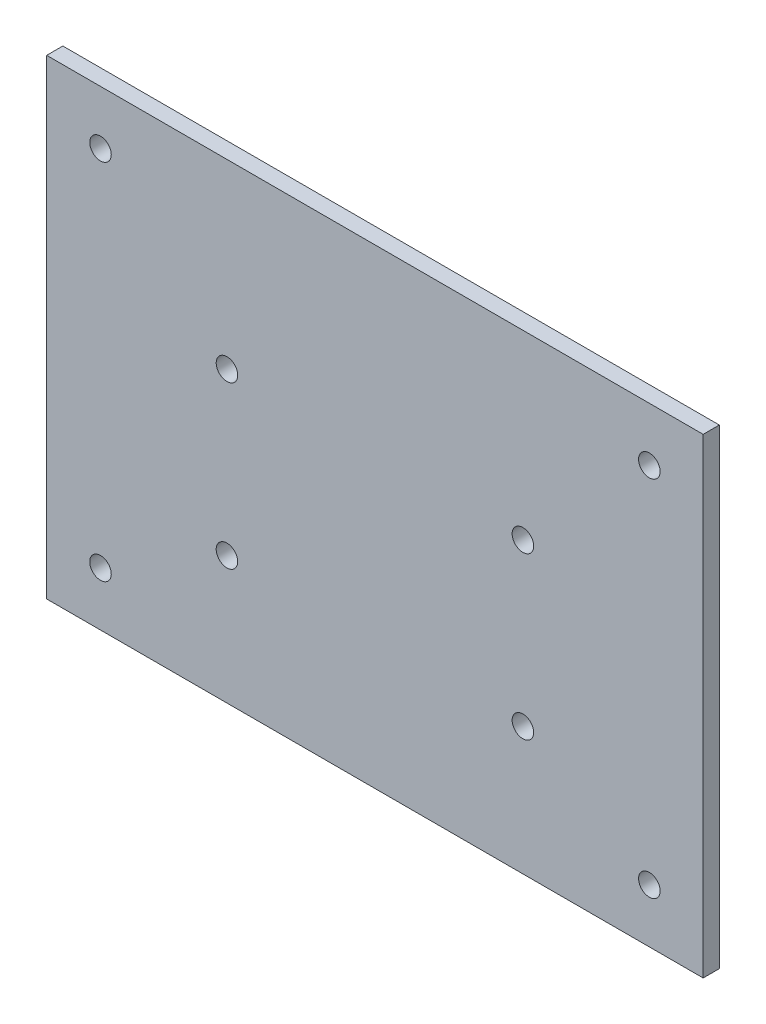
ISO-10303-21;
HEADER;
FILE_DESCRIPTION(('STEP AP214'),'2;1');
FILE_NAME('part.step','',(''),(''),'','','');
FILE_SCHEMA(('AUTOMOTIVE_DESIGN { 1 0 10303 214 1 1 1 1 }'));
ENDSEC;
DATA;
#1=APPLICATION_CONTEXT('core data for automotive mechanical design processes');
#2=APPLICATION_PROTOCOL_DEFINITION('international standard','automotive_design',2000,#1);
#3=PRODUCT_CONTEXT('',#1,'mechanical');
#4=PRODUCT('Part','Part','',(#3));
#5=PRODUCT_RELATED_PRODUCT_CATEGORY('part','',(#4));
#6=PRODUCT_DEFINITION_FORMATION('','',#4);
#7=PRODUCT_DEFINITION_CONTEXT('part definition',#1,'design');
#8=PRODUCT_DEFINITION('design','',#6,#7);
#9=PRODUCT_DEFINITION_SHAPE('','',#8);
#10=(LENGTH_UNIT() NAMED_UNIT(*) SI_UNIT(.MILLI.,.METRE.));
#11=(NAMED_UNIT(*) PLANE_ANGLE_UNIT() SI_UNIT($,.RADIAN.));
#12=(NAMED_UNIT(*) SI_UNIT($,.STERADIAN.) SOLID_ANGLE_UNIT());
#13=UNCERTAINTY_MEASURE_WITH_UNIT(LENGTH_MEASURE(1.E-05),#10,'distance_accuracy_value','');
#14=(GEOMETRIC_REPRESENTATION_CONTEXT(3) GLOBAL_UNCERTAINTY_ASSIGNED_CONTEXT((#13)) GLOBAL_UNIT_ASSIGNED_CONTEXT((#10,
#11,#12)) REPRESENTATION_CONTEXT('',''));
#15=CARTESIAN_POINT('',(0.,0.,0.));
#16=DIRECTION('',(0.,0.,1.));
#17=DIRECTION('',(1.,0.,0.));
#18=AXIS2_PLACEMENT_3D('',#15,#16,#17);
#19=CARTESIAN_POINT('',(61.,43.75,3.));
#20=DIRECTION('',(-1.,0.,0.));
#21=DIRECTION('',(0.,-1.,0.));
#22=AXIS2_PLACEMENT_3D('',#19,#20,#21);
#23=PLANE('',#22);
#24=DIRECTION('',(0.,1.,0.));
#25=VECTOR('',#24,1.);
#26=CARTESIAN_POINT('',(61.,43.75,0.));
#27=LINE('',#26,#25);
#28=CARTESIAN_POINT('',(61.,-43.75,0.));
#29=VERTEX_POINT('',#28);
#30=CARTESIAN_POINT('',(61.,43.75,0.));
#31=VERTEX_POINT('',#30);
#32=EDGE_CURVE('E97',#29,#31,#27,.T.);
#33=ORIENTED_EDGE('',*,*,#32,.T.);
#34=DIRECTION('',(0.,0.,-1.));
#35=VECTOR('',#34,1.);
#36=CARTESIAN_POINT('',(61.,43.75,3.));
#37=LINE('',#36,#35);
#38=CARTESIAN_POINT('',(61.,43.75,3.));
#39=VERTEX_POINT('',#38);
#40=EDGE_CURVE('E11',#39,#31,#37,.T.);
#41=ORIENTED_EDGE('',*,*,#40,.F.);
#42=DIRECTION('',(0.,1.,0.));
#43=VECTOR('',#42,1.);
#44=CARTESIAN_POINT('',(61.,43.75,3.));
#45=LINE('',#44,#43);
#46=CARTESIAN_POINT('',(61.,-43.75,3.));
#47=VERTEX_POINT('',#46);
#48=EDGE_CURVE('E85',#47,#39,#45,.T.);
#49=ORIENTED_EDGE('',*,*,#48,.F.);
#50=DIRECTION('',(0.,0.,-1.));
#51=VECTOR('',#50,1.);
#52=CARTESIAN_POINT('',(61.,-43.75,3.));
#53=LINE('',#52,#51);
#54=EDGE_CURVE('E93',#47,#29,#53,.T.);
#55=ORIENTED_EDGE('',*,*,#54,.T.);
#56=EDGE_LOOP('',(#33,#41,#49,#55));
#57=FACE_BOUND('',#56,.T.);
#58=ADVANCED_FACE('F34',(#57),#23,.F.);
#59=CARTESIAN_POINT('',(-61.,43.75,3.));
#60=DIRECTION('',(0.,-1.,0.));
#61=DIRECTION('',(0.,0.,-1.));
#62=AXIS2_PLACEMENT_3D('',#59,#60,#61);
#63=PLANE('',#62);
#64=DIRECTION('',(-1.,0.,0.));
#65=VECTOR('',#64,1.);
#66=CARTESIAN_POINT('',(-61.,43.75,0.));
#67=LINE('',#66,#65);
#68=CARTESIAN_POINT('',(-61.,43.75,0.));
#69=VERTEX_POINT('',#68);
#70=EDGE_CURVE('E89',#31,#69,#67,.T.);
#71=ORIENTED_EDGE('',*,*,#70,.T.);
#72=DIRECTION('',(0.,0.,-1.));
#73=VECTOR('',#72,1.);
#74=CARTESIAN_POINT('',(-61.,43.75,3.));
#75=LINE('',#74,#73);
#76=CARTESIAN_POINT('',(-61.,43.75,3.));
#77=VERTEX_POINT('',#76);
#78=EDGE_CURVE('E42',#77,#69,#75,.T.);
#79=ORIENTED_EDGE('',*,*,#78,.F.);
#80=DIRECTION('',(-1.,0.,0.));
#81=VECTOR('',#80,1.);
#82=CARTESIAN_POINT('',(-61.,43.75,3.));
#83=LINE('',#82,#81);
#84=EDGE_CURVE('E80',#39,#77,#83,.T.);
#85=ORIENTED_EDGE('',*,*,#84,.F.);
#86=ORIENTED_EDGE('',*,*,#40,.T.);
#87=EDGE_LOOP('',(#71,#79,#85,#86));
#88=FACE_BOUND('',#87,.T.);
#89=ADVANCED_FACE('F88',(#88),#63,.F.);
#90=CARTESIAN_POINT('',(-61.,43.75,3.));
#91=DIRECTION('',(1.,0.,0.));
#92=DIRECTION('',(0.,1.,0.));
#93=AXIS2_PLACEMENT_3D('',#90,#91,#92);
#94=PLANE('',#93);
#95=DIRECTION('',(0.,-1.,0.));
#96=VECTOR('',#95,1.);
#97=CARTESIAN_POINT('',(-61.,43.75,0.));
#98=LINE('',#97,#96);
#99=CARTESIAN_POINT('',(-61.,-43.75,0.));
#100=VERTEX_POINT('',#99);
#101=EDGE_CURVE('E67',#69,#100,#98,.T.);
#102=ORIENTED_EDGE('',*,*,#101,.T.);
#103=DIRECTION('',(0.,0.,-1.));
#104=VECTOR('',#103,1.);
#105=CARTESIAN_POINT('',(-61.,-43.75,3.));
#106=LINE('',#105,#104);
#107=CARTESIAN_POINT('',(-61.,-43.75,3.));
#108=VERTEX_POINT('',#107);
#109=EDGE_CURVE('E90',#108,#100,#106,.T.);
#110=ORIENTED_EDGE('',*,*,#109,.F.);
#111=DIRECTION('',(0.,-1.,0.));
#112=VECTOR('',#111,1.);
#113=CARTESIAN_POINT('',(-61.,43.75,3.));
#114=LINE('',#113,#112);
#115=EDGE_CURVE('E83',#77,#108,#114,.T.);
#116=ORIENTED_EDGE('',*,*,#115,.F.);
#117=ORIENTED_EDGE('',*,*,#78,.T.);
#118=EDGE_LOOP('',(#102,#110,#116,#117));
#119=FACE_BOUND('',#118,.T.);
#120=ADVANCED_FACE('F91',(#119),#94,.F.);
#121=CARTESIAN_POINT('',(-61.,-43.75,3.));
#122=DIRECTION('',(0.,1.,0.));
#123=DIRECTION('',(0.,0.,1.));
#124=AXIS2_PLACEMENT_3D('',#121,#122,#123);
#125=PLANE('',#124);
#126=DIRECTION('',(1.,0.,0.));
#127=VECTOR('',#126,1.);
#128=CARTESIAN_POINT('',(-61.,-43.75,0.));
#129=LINE('',#128,#127);
#130=EDGE_CURVE('E73',#100,#29,#129,.T.);
#131=ORIENTED_EDGE('',*,*,#130,.T.);
#132=ORIENTED_EDGE('',*,*,#54,.F.);
#133=DIRECTION('',(1.,0.,0.));
#134=VECTOR('',#133,1.);
#135=CARTESIAN_POINT('',(-61.,-43.75,3.));
#136=LINE('',#135,#134);
#137=EDGE_CURVE('E50',#108,#47,#136,.T.);
#138=ORIENTED_EDGE('',*,*,#137,.F.);
#139=ORIENTED_EDGE('',*,*,#109,.T.);
#140=EDGE_LOOP('',(#131,#132,#138,#139));
#141=FACE_BOUND('',#140,.T.);
#142=ADVANCED_FACE('F105',(#141),#125,.F.);
#143=CARTESIAN_POINT('',(0.,0.,3.));
#144=DIRECTION('',(0.,0.,1.));
#145=DIRECTION('',(1.,0.,0.));
#146=AXIS2_PLACEMENT_3D('',#143,#144,#145);
#147=PLANE('',#146);
#148=CARTESIAN_POINT('',(-51.,33.75,3.));
#149=DIRECTION('',(0.,0.,1.));
#150=DIRECTION('',(1.,0.,0.));
#151=AXIS2_PLACEMENT_3D('',#148,#149,#150);
#152=CIRCLE('',#151,1.99999999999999);
#153=CARTESIAN_POINT('',(-49.,33.75,3.));
#154=VERTEX_POINT('',#153);
#155=EDGE_CURVE('E155',#154,#154,#152,.T.);
#156=ORIENTED_EDGE('',*,*,#155,.F.);
#157=EDGE_LOOP('',(#156));
#158=FACE_BOUND('',#157,.T.);
#159=CARTESIAN_POINT('',(-51.,-33.75,3.));
#160=DIRECTION('',(0.,0.,1.));
#161=DIRECTION('',(1.,0.,0.));
#162=AXIS2_PLACEMENT_3D('',#159,#160,#161);
#163=CIRCLE('',#162,1.99999999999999);
#164=CARTESIAN_POINT('',(-49.,-33.75,3.));
#165=VERTEX_POINT('',#164);
#166=EDGE_CURVE('E149',#165,#165,#163,.T.);
#167=ORIENTED_EDGE('',*,*,#166,.F.);
#168=EDGE_LOOP('',(#167));
#169=FACE_BOUND('',#168,.T.);
#170=CARTESIAN_POINT('',(51.,33.75,3.));
#171=DIRECTION('',(0.,0.,1.));
#172=DIRECTION('',(1.,0.,0.));
#173=AXIS2_PLACEMENT_3D('',#170,#171,#172);
#174=CIRCLE('',#173,1.99999999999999);
#175=CARTESIAN_POINT('',(53.,33.75,3.));
#176=VERTEX_POINT('',#175);
#177=EDGE_CURVE('E143',#176,#176,#174,.T.);
#178=ORIENTED_EDGE('',*,*,#177,.F.);
#179=EDGE_LOOP('',(#178));
#180=FACE_BOUND('',#179,.T.);
#181=CARTESIAN_POINT('',(51.,-33.75,3.));
#182=DIRECTION('',(0.,0.,1.));
#183=DIRECTION('',(1.,0.,0.));
#184=AXIS2_PLACEMENT_3D('',#181,#182,#183);
#185=CIRCLE('',#184,1.99999999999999);
#186=CARTESIAN_POINT('',(53.,-33.75,3.));
#187=VERTEX_POINT('',#186);
#188=EDGE_CURVE('E137',#187,#187,#185,.T.);
#189=ORIENTED_EDGE('',*,*,#188,.F.);
#190=EDGE_LOOP('',(#189));
#191=FACE_BOUND('',#190,.T.);
#192=CARTESIAN_POINT('',(-27.5,10.,3.));
#193=DIRECTION('',(0.,0.,1.));
#194=DIRECTION('',(1.,0.,0.));
#195=AXIS2_PLACEMENT_3D('',#192,#193,#194);
#196=CIRCLE('',#195,1.99999999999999);
#197=CARTESIAN_POINT('',(-25.5,10.,3.));
#198=VERTEX_POINT('',#197);
#199=EDGE_CURVE('E131',#198,#198,#196,.T.);
#200=ORIENTED_EDGE('',*,*,#199,.F.);
#201=EDGE_LOOP('',(#200));
#202=FACE_BOUND('',#201,.T.);
#203=CARTESIAN_POINT('',(-27.5,-20.,3.));
#204=DIRECTION('',(0.,0.,1.));
#205=DIRECTION('',(1.,0.,0.));
#206=AXIS2_PLACEMENT_3D('',#203,#204,#205);
#207=CIRCLE('',#206,1.99999999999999);
#208=CARTESIAN_POINT('',(-25.5,-20.,3.));
#209=VERTEX_POINT('',#208);
#210=EDGE_CURVE('E125',#209,#209,#207,.T.);
#211=ORIENTED_EDGE('',*,*,#210,.F.);
#212=EDGE_LOOP('',(#211));
#213=FACE_BOUND('',#212,.T.);
#214=CARTESIAN_POINT('',(27.5,10.,3.));
#215=DIRECTION('',(0.,0.,1.));
#216=DIRECTION('',(1.,0.,0.));
#217=AXIS2_PLACEMENT_3D('',#214,#215,#216);
#218=CIRCLE('',#217,1.99999999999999);
#219=CARTESIAN_POINT('',(29.5,10.,3.));
#220=VERTEX_POINT('',#219);
#221=EDGE_CURVE('E119',#220,#220,#218,.T.);
#222=ORIENTED_EDGE('',*,*,#221,.F.);
#223=EDGE_LOOP('',(#222));
#224=FACE_BOUND('',#223,.T.);
#225=CARTESIAN_POINT('',(27.5,-20.,3.));
#226=DIRECTION('',(0.,0.,1.));
#227=DIRECTION('',(1.,0.,0.));
#228=AXIS2_PLACEMENT_3D('',#225,#226,#227);
#229=CIRCLE('',#228,1.99999999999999);
#230=CARTESIAN_POINT('',(29.5,-20.,3.));
#231=VERTEX_POINT('',#230);
#232=EDGE_CURVE('E113',#231,#231,#229,.T.);
#233=ORIENTED_EDGE('',*,*,#232,.F.);
#234=EDGE_LOOP('',(#233));
#235=FACE_BOUND('',#234,.T.);
#236=ORIENTED_EDGE('',*,*,#48,.T.);
#237=ORIENTED_EDGE('',*,*,#84,.T.);
#238=ORIENTED_EDGE('',*,*,#115,.T.);
#239=ORIENTED_EDGE('',*,*,#137,.T.);
#240=EDGE_LOOP('',(#236,#237,#238,#239));
#241=FACE_BOUND('',#240,.T.);
#242=ADVANCED_FACE('F81',(#158,#169,#180,#191,#202,#213,#224,#235,#241),#147,.T.);
#243=CARTESIAN_POINT('',(0.,0.,0.));
#244=DIRECTION('',(0.,0.,1.));
#245=DIRECTION('',(1.,0.,0.));
#246=AXIS2_PLACEMENT_3D('',#243,#244,#245);
#247=PLANE('',#246);
#248=CARTESIAN_POINT('',(-51.,33.75,0.));
#249=DIRECTION('',(0.,0.,1.));
#250=DIRECTION('',(1.,0.,0.));
#251=AXIS2_PLACEMENT_3D('',#248,#249,#250);
#252=CIRCLE('',#251,1.99999999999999);
#253=CARTESIAN_POINT('',(-49.,33.75,0.));
#254=VERTEX_POINT('',#253);
#255=EDGE_CURVE('E152',#254,#254,#252,.T.);
#256=ORIENTED_EDGE('',*,*,#255,.T.);
#257=EDGE_LOOP('',(#256));
#258=FACE_BOUND('',#257,.T.);
#259=CARTESIAN_POINT('',(-51.,-33.75,0.));
#260=DIRECTION('',(0.,0.,1.));
#261=DIRECTION('',(1.,0.,0.));
#262=AXIS2_PLACEMENT_3D('',#259,#260,#261);
#263=CIRCLE('',#262,1.99999999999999);
#264=CARTESIAN_POINT('',(-49.,-33.75,0.));
#265=VERTEX_POINT('',#264);
#266=EDGE_CURVE('E146',#265,#265,#263,.T.);
#267=ORIENTED_EDGE('',*,*,#266,.T.);
#268=EDGE_LOOP('',(#267));
#269=FACE_BOUND('',#268,.T.);
#270=CARTESIAN_POINT('',(51.,33.75,0.));
#271=DIRECTION('',(0.,0.,1.));
#272=DIRECTION('',(1.,0.,0.));
#273=AXIS2_PLACEMENT_3D('',#270,#271,#272);
#274=CIRCLE('',#273,1.99999999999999);
#275=CARTESIAN_POINT('',(53.,33.75,0.));
#276=VERTEX_POINT('',#275);
#277=EDGE_CURVE('E140',#276,#276,#274,.T.);
#278=ORIENTED_EDGE('',*,*,#277,.T.);
#279=EDGE_LOOP('',(#278));
#280=FACE_BOUND('',#279,.T.);
#281=CARTESIAN_POINT('',(51.,-33.75,0.));
#282=DIRECTION('',(0.,0.,1.));
#283=DIRECTION('',(1.,0.,0.));
#284=AXIS2_PLACEMENT_3D('',#281,#282,#283);
#285=CIRCLE('',#284,1.99999999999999);
#286=CARTESIAN_POINT('',(53.,-33.75,0.));
#287=VERTEX_POINT('',#286);
#288=EDGE_CURVE('E134',#287,#287,#285,.T.);
#289=ORIENTED_EDGE('',*,*,#288,.T.);
#290=EDGE_LOOP('',(#289));
#291=FACE_BOUND('',#290,.T.);
#292=CARTESIAN_POINT('',(-27.5,10.,0.));
#293=DIRECTION('',(0.,0.,1.));
#294=DIRECTION('',(1.,0.,0.));
#295=AXIS2_PLACEMENT_3D('',#292,#293,#294);
#296=CIRCLE('',#295,2.);
#297=CARTESIAN_POINT('',(-25.5,10.,0.));
#298=VERTEX_POINT('',#297);
#299=EDGE_CURVE('E128',#298,#298,#296,.T.);
#300=ORIENTED_EDGE('',*,*,#299,.T.);
#301=EDGE_LOOP('',(#300));
#302=FACE_BOUND('',#301,.T.);
#303=CARTESIAN_POINT('',(-27.5,-20.,0.));
#304=DIRECTION('',(0.,0.,1.));
#305=DIRECTION('',(1.,0.,0.));
#306=AXIS2_PLACEMENT_3D('',#303,#304,#305);
#307=CIRCLE('',#306,2.);
#308=CARTESIAN_POINT('',(-25.5,-20.,0.));
#309=VERTEX_POINT('',#308);
#310=EDGE_CURVE('E122',#309,#309,#307,.T.);
#311=ORIENTED_EDGE('',*,*,#310,.T.);
#312=EDGE_LOOP('',(#311));
#313=FACE_BOUND('',#312,.T.);
#314=CARTESIAN_POINT('',(27.5,10.,0.));
#315=DIRECTION('',(0.,0.,1.));
#316=DIRECTION('',(1.,0.,0.));
#317=AXIS2_PLACEMENT_3D('',#314,#315,#316);
#318=CIRCLE('',#317,2.);
#319=CARTESIAN_POINT('',(29.5,10.,0.));
#320=VERTEX_POINT('',#319);
#321=EDGE_CURVE('E116',#320,#320,#318,.T.);
#322=ORIENTED_EDGE('',*,*,#321,.T.);
#323=EDGE_LOOP('',(#322));
#324=FACE_BOUND('',#323,.T.);
#325=CARTESIAN_POINT('',(27.5,-20.,0.));
#326=DIRECTION('',(0.,0.,1.));
#327=DIRECTION('',(1.,0.,0.));
#328=AXIS2_PLACEMENT_3D('',#325,#326,#327);
#329=CIRCLE('',#328,2.);
#330=CARTESIAN_POINT('',(29.5,-20.,0.));
#331=VERTEX_POINT('',#330);
#332=EDGE_CURVE('E100',#331,#331,#329,.T.);
#333=ORIENTED_EDGE('',*,*,#332,.T.);
#334=EDGE_LOOP('',(#333));
#335=FACE_BOUND('',#334,.T.);
#336=ORIENTED_EDGE('',*,*,#32,.F.);
#337=ORIENTED_EDGE('',*,*,#130,.F.);
#338=ORIENTED_EDGE('',*,*,#101,.F.);
#339=ORIENTED_EDGE('',*,*,#70,.F.);
#340=EDGE_LOOP('',(#336,#337,#338,#339));
#341=FACE_BOUND('',#340,.T.);
#342=ADVANCED_FACE('F108',(#258,#269,#280,#291,#302,#313,#324,#335,#341),#247,.F.);
#343=CARTESIAN_POINT('',(27.5,-20.,3.));
#344=DIRECTION('',(0.,0.,1.));
#345=DIRECTION('',(1.,0.,0.));
#346=AXIS2_PLACEMENT_3D('',#343,#344,#345);
#347=CYLINDRICAL_SURFACE('',#346,1.99999999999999);
#348=ORIENTED_EDGE('',*,*,#332,.F.);
#349=EDGE_LOOP('',(#348));
#350=FACE_BOUND('',#349,.T.);
#351=ORIENTED_EDGE('',*,*,#232,.T.);
#352=EDGE_LOOP('',(#351));
#353=FACE_BOUND('',#352,.T.);
#354=ADVANCED_FACE('F178',(#350,#353),#347,.F.);
#355=CARTESIAN_POINT('',(27.5,10.,3.));
#356=DIRECTION('',(0.,0.,1.));
#357=DIRECTION('',(1.,0.,0.));
#358=AXIS2_PLACEMENT_3D('',#355,#356,#357);
#359=CYLINDRICAL_SURFACE('',#358,1.99999999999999);
#360=ORIENTED_EDGE('',*,*,#321,.F.);
#361=EDGE_LOOP('',(#360));
#362=FACE_BOUND('',#361,.T.);
#363=ORIENTED_EDGE('',*,*,#221,.T.);
#364=EDGE_LOOP('',(#363));
#365=FACE_BOUND('',#364,.T.);
#366=ADVANCED_FACE('F180',(#362,#365),#359,.F.);
#367=CARTESIAN_POINT('',(-27.5,-20.,3.));
#368=DIRECTION('',(0.,0.,1.));
#369=DIRECTION('',(1.,0.,0.));
#370=AXIS2_PLACEMENT_3D('',#367,#368,#369);
#371=CYLINDRICAL_SURFACE('',#370,1.99999999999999);
#372=ORIENTED_EDGE('',*,*,#310,.F.);
#373=EDGE_LOOP('',(#372));
#374=FACE_BOUND('',#373,.T.);
#375=ORIENTED_EDGE('',*,*,#210,.T.);
#376=EDGE_LOOP('',(#375));
#377=FACE_BOUND('',#376,.T.);
#378=ADVANCED_FACE('F187',(#374,#377),#371,.F.);
#379=CARTESIAN_POINT('',(-27.5,10.,3.));
#380=DIRECTION('',(0.,0.,1.));
#381=DIRECTION('',(1.,0.,0.));
#382=AXIS2_PLACEMENT_3D('',#379,#380,#381);
#383=CYLINDRICAL_SURFACE('',#382,1.99999999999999);
#384=ORIENTED_EDGE('',*,*,#299,.F.);
#385=EDGE_LOOP('',(#384));
#386=FACE_BOUND('',#385,.T.);
#387=ORIENTED_EDGE('',*,*,#199,.T.);
#388=EDGE_LOOP('',(#387));
#389=FACE_BOUND('',#388,.T.);
#390=ADVANCED_FACE('F228',(#386,#389),#383,.F.);
#391=CARTESIAN_POINT('',(51.,-33.75,3.));
#392=DIRECTION('',(0.,0.,1.));
#393=DIRECTION('',(1.,0.,0.));
#394=AXIS2_PLACEMENT_3D('',#391,#392,#393);
#395=CYLINDRICAL_SURFACE('',#394,1.99999999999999);
#396=ORIENTED_EDGE('',*,*,#288,.F.);
#397=EDGE_LOOP('',(#396));
#398=FACE_BOUND('',#397,.T.);
#399=ORIENTED_EDGE('',*,*,#188,.T.);
#400=EDGE_LOOP('',(#399));
#401=FACE_BOUND('',#400,.T.);
#402=ADVANCED_FACE('F222',(#398,#401),#395,.F.);
#403=CARTESIAN_POINT('',(51.,33.75,3.));
#404=DIRECTION('',(0.,0.,1.));
#405=DIRECTION('',(1.,0.,0.));
#406=AXIS2_PLACEMENT_3D('',#403,#404,#405);
#407=CYLINDRICAL_SURFACE('',#406,1.99999999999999);
#408=ORIENTED_EDGE('',*,*,#277,.F.);
#409=EDGE_LOOP('',(#408));
#410=FACE_BOUND('',#409,.T.);
#411=ORIENTED_EDGE('',*,*,#177,.T.);
#412=EDGE_LOOP('',(#411));
#413=FACE_BOUND('',#412,.T.);
#414=ADVANCED_FACE('F227',(#410,#413),#407,.F.);
#415=CARTESIAN_POINT('',(-51.,-33.75,3.));
#416=DIRECTION('',(0.,0.,1.));
#417=DIRECTION('',(1.,0.,0.));
#418=AXIS2_PLACEMENT_3D('',#415,#416,#417);
#419=CYLINDRICAL_SURFACE('',#418,1.99999999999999);
#420=ORIENTED_EDGE('',*,*,#266,.F.);
#421=EDGE_LOOP('',(#420));
#422=FACE_BOUND('',#421,.T.);
#423=ORIENTED_EDGE('',*,*,#166,.T.);
#424=EDGE_LOOP('',(#423));
#425=FACE_BOUND('',#424,.T.);
#426=ADVANCED_FACE('F240',(#422,#425),#419,.F.);
#427=CARTESIAN_POINT('',(-51.,33.75,3.));
#428=DIRECTION('',(0.,0.,1.));
#429=DIRECTION('',(1.,0.,0.));
#430=AXIS2_PLACEMENT_3D('',#427,#428,#429);
#431=CYLINDRICAL_SURFACE('',#430,1.99999999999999);
#432=ORIENTED_EDGE('',*,*,#255,.F.);
#433=EDGE_LOOP('',(#432));
#434=FACE_BOUND('',#433,.T.);
#435=ORIENTED_EDGE('',*,*,#155,.T.);
#436=EDGE_LOOP('',(#435));
#437=FACE_BOUND('',#436,.T.);
#438=ADVANCED_FACE('F159',(#434,#437),#431,.F.);
#439=CLOSED_SHELL('',(#58,#89,#120,#142,#242,#342,#354,#366,#378,#390,#402,#414,#426,#438));
#440=MANIFOLD_SOLID_BREP('B2',#439);
#441=ADVANCED_BREP_SHAPE_REPRESENTATION('',(#18,#440),#14);
#442=SHAPE_DEFINITION_REPRESENTATION(#9,#441);
ENDSEC;
END-ISO-10303-21;
